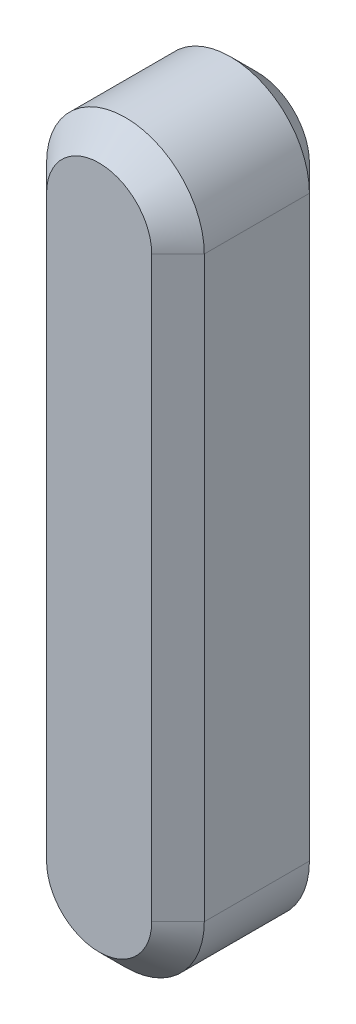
from build123d import *

# Parameters (mm, degrees)
BOSS_EXTRU_1_DEPTH = 3
CHANFREIN1_SIZE    = 0.5


with BuildPart() as part:
    # Esquisse1 → Boss.-Extru.1 (new body)
    with BuildSketch(Plane.XY):
        with BuildLine():
            Line((-1.5, 0), (-1.5, -11))
            ThreePointArc((-1.5, -11), (0, -12.5), (1.5, -11))
            Line((1.5, -11), (1.5, 0))
            ThreePointArc((1.5, 0), (0, 1.5), (-1.5, 0))
        make_face()
    extrude(amount=BOSS_EXTRU_1_DEPTH)

    # Chanfrein1
    chanfrein1_edges = [part.edges().sort_by_distance(p)[0] for p in [
        (0, -12.5, 3),
        (1.5, -5.5, 3),
        (0, 1.5, 3),
        (1.5, -5.5, 0),
        (0, -12.5, 0),
        (-1.5, -5.5, 0),
        (0, 1.5, 0),
        (-1.5, -5.5, 3),
    ]]
    chamfer(chanfrein1_edges, length=CHANFREIN1_SIZE)


solid = part.part
